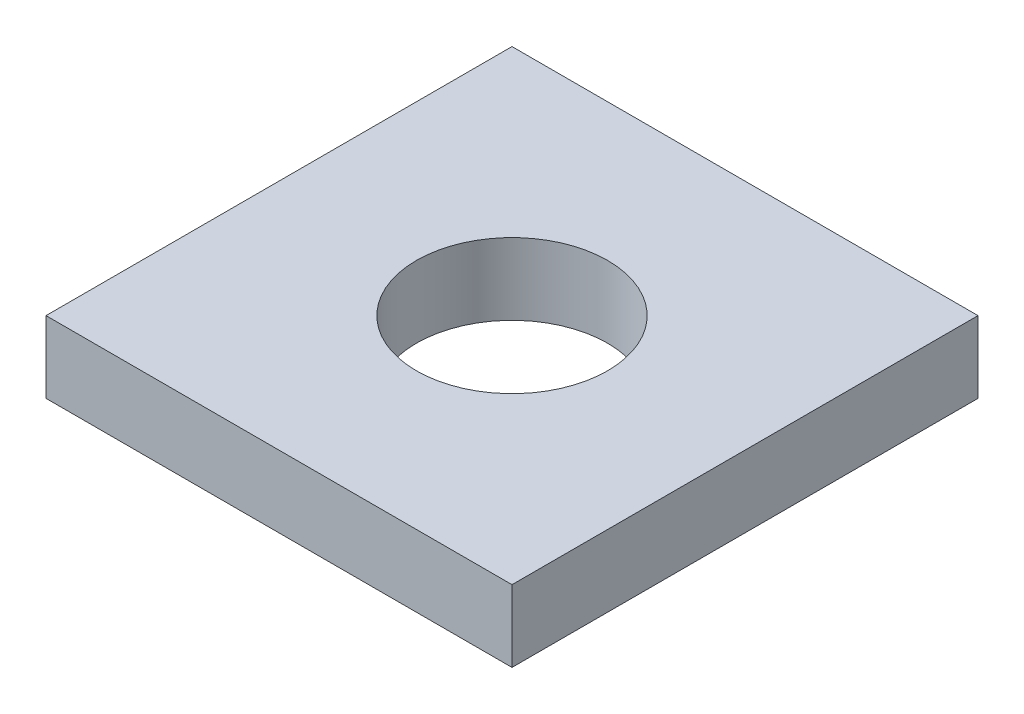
ISO-10303-21;
HEADER;
FILE_DESCRIPTION(('STEP AP214'),'2;1');
FILE_NAME('part.step','',(''),(''),'','','');
FILE_SCHEMA(('AUTOMOTIVE_DESIGN { 1 0 10303 214 1 1 1 1 }'));
ENDSEC;
DATA;
#1=APPLICATION_CONTEXT('core data for automotive mechanical design processes');
#2=APPLICATION_PROTOCOL_DEFINITION('international standard','automotive_design',2000,#1);
#3=PRODUCT_CONTEXT('',#1,'mechanical');
#4=PRODUCT('Part','Part','',(#3));
#5=PRODUCT_RELATED_PRODUCT_CATEGORY('part','',(#4));
#6=PRODUCT_DEFINITION_FORMATION('','',#4);
#7=PRODUCT_DEFINITION_CONTEXT('part definition',#1,'design');
#8=PRODUCT_DEFINITION('design','',#6,#7);
#9=PRODUCT_DEFINITION_SHAPE('','',#8);
#10=(LENGTH_UNIT() NAMED_UNIT(*) SI_UNIT(.MILLI.,.METRE.));
#11=(NAMED_UNIT(*) PLANE_ANGLE_UNIT() SI_UNIT($,.RADIAN.));
#12=(NAMED_UNIT(*) SI_UNIT($,.STERADIAN.) SOLID_ANGLE_UNIT());
#13=UNCERTAINTY_MEASURE_WITH_UNIT(LENGTH_MEASURE(1.E-05),#10,'distance_accuracy_value','');
#14=(GEOMETRIC_REPRESENTATION_CONTEXT(3) GLOBAL_UNCERTAINTY_ASSIGNED_CONTEXT((#13)) GLOBAL_UNIT_ASSIGNED_CONTEXT((#10,
#11,#12)) REPRESENTATION_CONTEXT('',''));
#15=CARTESIAN_POINT('',(0.,0.,0.));
#16=DIRECTION('',(0.,0.,1.));
#17=DIRECTION('',(1.,0.,0.));
#18=AXIS2_PLACEMENT_3D('',#15,#16,#17);
#19=CARTESIAN_POINT('',(0.,1.5,0.));
#20=DIRECTION('',(0.,-1.,0.));
#21=DIRECTION('',(0.,0.,-1.));
#22=AXIS2_PLACEMENT_3D('',#19,#20,#21);
#23=PLANE('',#22);
#24=DIRECTION('',(0.,0.,1.));
#25=VECTOR('',#24,1.);
#26=CARTESIAN_POINT('',(0.,1.5,0.));
#27=LINE('',#26,#25);
#28=CARTESIAN_POINT('',(0.,1.5,-9.75));
#29=VERTEX_POINT('',#28);
#30=CARTESIAN_POINT('',(0.,1.5,0.));
#31=VERTEX_POINT('',#30);
#32=EDGE_CURVE('E86',#29,#31,#27,.T.);
#33=ORIENTED_EDGE('',*,*,#32,.T.);
#34=DIRECTION('',(1.,0.,0.));
#35=VECTOR('',#34,1.);
#36=CARTESIAN_POINT('',(0.,1.5,0.));
#37=LINE('',#36,#35);
#38=CARTESIAN_POINT('',(9.75,1.5,0.));
#39=VERTEX_POINT('',#38);
#40=EDGE_CURVE('E81',#31,#39,#37,.T.);
#41=ORIENTED_EDGE('',*,*,#40,.T.);
#42=DIRECTION('',(0.,0.,-1.));
#43=VECTOR('',#42,1.);
#44=CARTESIAN_POINT('',(9.75,1.5,0.));
#45=LINE('',#44,#43);
#46=CARTESIAN_POINT('',(9.75,1.5,-9.75));
#47=VERTEX_POINT('',#46);
#48=EDGE_CURVE('E84',#39,#47,#45,.T.);
#49=ORIENTED_EDGE('',*,*,#48,.T.);
#50=DIRECTION('',(-1.,0.,0.));
#51=VECTOR('',#50,1.);
#52=CARTESIAN_POINT('',(0.,1.5,-9.75));
#53=LINE('',#52,#51);
#54=EDGE_CURVE('E51',#47,#29,#53,.T.);
#55=ORIENTED_EDGE('',*,*,#54,.T.);
#56=EDGE_LOOP('',(#33,#41,#49,#55));
#57=FACE_BOUND('',#56,.T.);
#58=CARTESIAN_POINT('',(4.875,1.5,-4.875));
#59=DIRECTION('',(0.,1.,0.));
#60=DIRECTION('',(0.,0.,1.));
#61=AXIS2_PLACEMENT_3D('',#58,#59,#60);
#62=CIRCLE('',#61,2.);
#63=CARTESIAN_POINT('',(4.875,1.5,-2.875));
#64=VERTEX_POINT('',#63);
#65=EDGE_CURVE('E101',#64,#64,#62,.T.);
#66=ORIENTED_EDGE('',*,*,#65,.F.);
#67=EDGE_LOOP('',(#66));
#68=FACE_BOUND('',#67,.T.);
#69=ADVANCED_FACE('F34',(#57,#68),#23,.F.);
#70=CARTESIAN_POINT('',(0.,0.,0.));
#71=DIRECTION('',(0.,-1.,0.));
#72=DIRECTION('',(0.,0.,-1.));
#73=AXIS2_PLACEMENT_3D('',#70,#71,#72);
#74=PLANE('',#73);
#75=DIRECTION('',(0.,0.,1.));
#76=VECTOR('',#75,1.);
#77=CARTESIAN_POINT('',(0.,0.,0.));
#78=LINE('',#77,#76);
#79=CARTESIAN_POINT('',(0.,0.,-9.75));
#80=VERTEX_POINT('',#79);
#81=CARTESIAN_POINT('',(0.,0.,0.));
#82=VERTEX_POINT('',#81);
#83=EDGE_CURVE('E98',#80,#82,#78,.T.);
#84=ORIENTED_EDGE('',*,*,#83,.F.);
#85=DIRECTION('',(-1.,0.,0.));
#86=VECTOR('',#85,1.);
#87=CARTESIAN_POINT('',(0.,0.,-9.75));
#88=LINE('',#87,#86);
#89=CARTESIAN_POINT('',(9.75,0.,-9.75));
#90=VERTEX_POINT('',#89);
#91=EDGE_CURVE('E74',#90,#80,#88,.T.);
#92=ORIENTED_EDGE('',*,*,#91,.F.);
#93=DIRECTION('',(0.,0.,-1.));
#94=VECTOR('',#93,1.);
#95=CARTESIAN_POINT('',(9.75,0.,0.));
#96=LINE('',#95,#94);
#97=CARTESIAN_POINT('',(9.75,0.,0.));
#98=VERTEX_POINT('',#97);
#99=EDGE_CURVE('E68',#98,#90,#96,.T.);
#100=ORIENTED_EDGE('',*,*,#99,.F.);
#101=DIRECTION('',(1.,0.,0.));
#102=VECTOR('',#101,1.);
#103=CARTESIAN_POINT('',(0.,0.,0.));
#104=LINE('',#103,#102);
#105=EDGE_CURVE('E90',#82,#98,#104,.T.);
#106=ORIENTED_EDGE('',*,*,#105,.F.);
#107=EDGE_LOOP('',(#84,#92,#100,#106));
#108=FACE_BOUND('',#107,.T.);
#109=CARTESIAN_POINT('',(4.875,0.,-4.875));
#110=DIRECTION('',(0.,1.,0.));
#111=DIRECTION('',(0.,0.,1.));
#112=AXIS2_PLACEMENT_3D('',#109,#110,#111);
#113=CIRCLE('',#112,2.);
#114=CARTESIAN_POINT('',(4.875,0.,-2.875));
#115=VERTEX_POINT('',#114);
#116=EDGE_CURVE('E113',#115,#115,#113,.T.);
#117=ORIENTED_EDGE('',*,*,#116,.T.);
#118=EDGE_LOOP('',(#117));
#119=FACE_BOUND('',#118,.T.);
#120=ADVANCED_FACE('F109',(#108,#119),#74,.T.);
#121=CARTESIAN_POINT('',(0.,1.5,0.));
#122=DIRECTION('',(1.,0.,0.));
#123=DIRECTION('',(0.,0.,-1.));
#124=AXIS2_PLACEMENT_3D('',#121,#122,#123);
#125=PLANE('',#124);
#126=ORIENTED_EDGE('',*,*,#83,.T.);
#127=DIRECTION('',(0.,-1.,0.));
#128=VECTOR('',#127,1.);
#129=CARTESIAN_POINT('',(0.,1.5,0.));
#130=LINE('',#129,#128);
#131=EDGE_CURVE('E11',#31,#82,#130,.T.);
#132=ORIENTED_EDGE('',*,*,#131,.F.);
#133=ORIENTED_EDGE('',*,*,#32,.F.);
#134=DIRECTION('',(0.,-1.,0.));
#135=VECTOR('',#134,1.);
#136=CARTESIAN_POINT('',(0.,1.5,-9.75));
#137=LINE('',#136,#135);
#138=EDGE_CURVE('E94',#29,#80,#137,.T.);
#139=ORIENTED_EDGE('',*,*,#138,.T.);
#140=EDGE_LOOP('',(#126,#132,#133,#139));
#141=FACE_BOUND('',#140,.T.);
#142=ADVANCED_FACE('F36',(#141),#125,.F.);
#143=CARTESIAN_POINT('',(0.,1.5,0.));
#144=DIRECTION('',(0.,0.,-1.));
#145=DIRECTION('',(-1.,0.,0.));
#146=AXIS2_PLACEMENT_3D('',#143,#144,#145);
#147=PLANE('',#146);
#148=ORIENTED_EDGE('',*,*,#105,.T.);
#149=DIRECTION('',(0.,-1.,0.));
#150=VECTOR('',#149,1.);
#151=CARTESIAN_POINT('',(9.75,1.5,0.));
#152=LINE('',#151,#150);
#153=EDGE_CURVE('E43',#39,#98,#152,.T.);
#154=ORIENTED_EDGE('',*,*,#153,.F.);
#155=ORIENTED_EDGE('',*,*,#40,.F.);
#156=ORIENTED_EDGE('',*,*,#131,.T.);
#157=EDGE_LOOP('',(#148,#154,#155,#156));
#158=FACE_BOUND('',#157,.T.);
#159=ADVANCED_FACE('F89',(#158),#147,.F.);
#160=CARTESIAN_POINT('',(9.75,1.5,0.));
#161=DIRECTION('',(-1.,0.,0.));
#162=DIRECTION('',(0.,0.,1.));
#163=AXIS2_PLACEMENT_3D('',#160,#161,#162);
#164=PLANE('',#163);
#165=ORIENTED_EDGE('',*,*,#99,.T.);
#166=DIRECTION('',(0.,-1.,0.));
#167=VECTOR('',#166,1.);
#168=CARTESIAN_POINT('',(9.75,1.5,-9.75));
#169=LINE('',#168,#167);
#170=EDGE_CURVE('E91',#47,#90,#169,.T.);
#171=ORIENTED_EDGE('',*,*,#170,.F.);
#172=ORIENTED_EDGE('',*,*,#48,.F.);
#173=ORIENTED_EDGE('',*,*,#153,.T.);
#174=EDGE_LOOP('',(#165,#171,#172,#173));
#175=FACE_BOUND('',#174,.T.);
#176=ADVANCED_FACE('F92',(#175),#164,.F.);
#177=CARTESIAN_POINT('',(0.,1.5,-9.75));
#178=DIRECTION('',(0.,0.,1.));
#179=DIRECTION('',(1.,0.,0.));
#180=AXIS2_PLACEMENT_3D('',#177,#178,#179);
#181=PLANE('',#180);
#182=ORIENTED_EDGE('',*,*,#91,.T.);
#183=ORIENTED_EDGE('',*,*,#138,.F.);
#184=ORIENTED_EDGE('',*,*,#54,.F.);
#185=ORIENTED_EDGE('',*,*,#170,.T.);
#186=EDGE_LOOP('',(#182,#183,#184,#185));
#187=FACE_BOUND('',#186,.T.);
#188=ADVANCED_FACE('F106',(#187),#181,.F.);
#189=CARTESIAN_POINT('',(4.875,1.5,-4.875));
#190=DIRECTION('',(0.,-1.,0.));
#191=DIRECTION('',(0.,0.,-1.));
#192=AXIS2_PLACEMENT_3D('',#189,#190,#191);
#193=CYLINDRICAL_SURFACE('',#192,2.);
#194=ORIENTED_EDGE('',*,*,#65,.T.);
#195=EDGE_LOOP('',(#194));
#196=FACE_BOUND('',#195,.T.);
#197=ORIENTED_EDGE('',*,*,#116,.F.);
#198=EDGE_LOOP('',(#197));
#199=FACE_BOUND('',#198,.T.);
#200=ADVANCED_FACE('F119',(#196,#199),#193,.F.);
#201=CLOSED_SHELL('',(#69,#120,#142,#159,#176,#188,#200));
#202=MANIFOLD_SOLID_BREP('B2',#201);
#203=ADVANCED_BREP_SHAPE_REPRESENTATION('',(#18,#202),#14);
#204=SHAPE_DEFINITION_REPRESENTATION(#9,#203);
ENDSEC;
END-ISO-10303-21;
